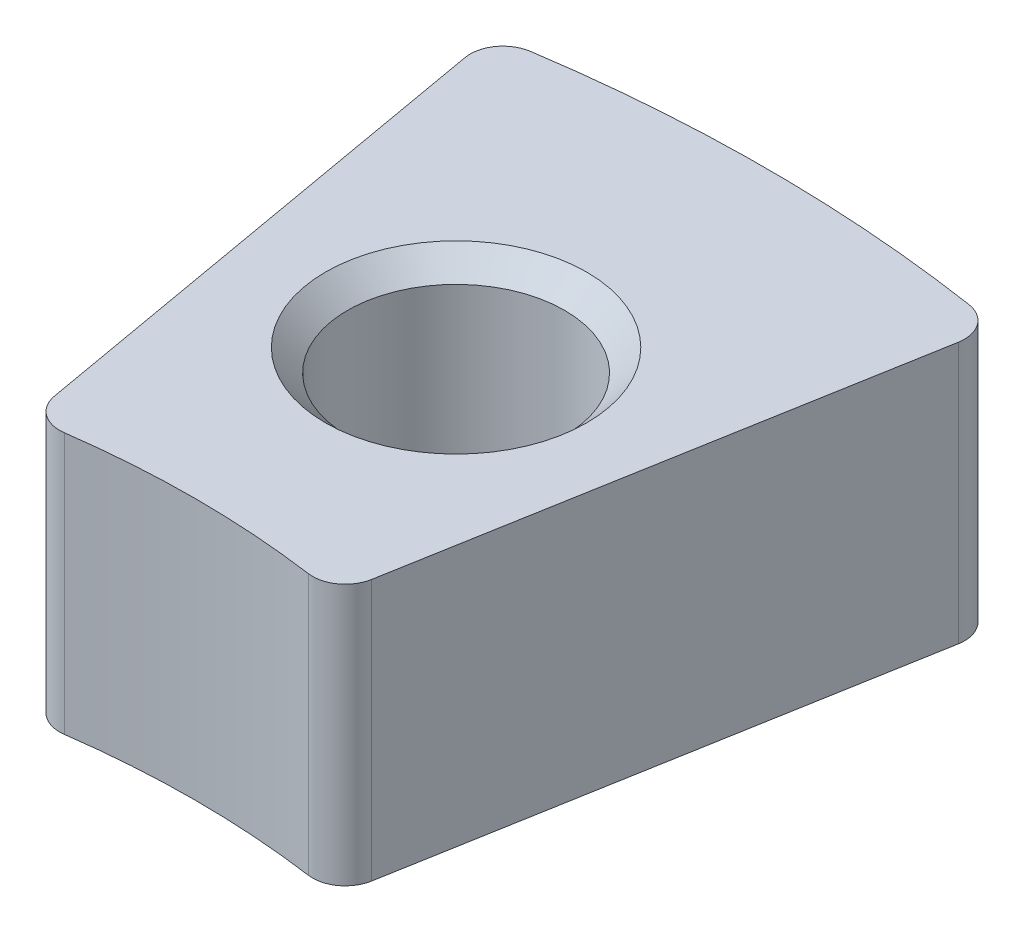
from build123d import *

# Parameters (mm, degrees)
LINEAR_AUSTRAGEN1_DEPTH = 8


with BuildPart() as part:
    # Skizze1 → Linear austragen1 (new body)
    with BuildSketch(Plane(origin=(0, 0, 0), x_dir=(1, 0, 0), z_dir=(0, 1, 0))):
        with BuildLine():
            Line((-7.551699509, 7.827816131), (-4.859047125, -7.44297438))
            ThreePointArc((-4.859047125, -7.44297438), (-4.46235437, -8.078103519), (-3.73587368, -8.259707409))
            ThreePointArc((-3.73587368, -8.259707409), (0, -8), (3.73587368, -8.259707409))
            ThreePointArc((3.73587368, -8.259707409), (4.46235437, -8.078103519), (4.859047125, -7.44297438))
            Line((4.859047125, -7.44297438), (7.551699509, 7.827816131))
            ThreePointArc((7.551699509, 7.827816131), (7.37939641, 8.584419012), (6.717854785, 8.990003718))
            ThreePointArc((6.717854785, 8.990003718), (0, 9.5), (-6.717854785, 8.990003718))
            ThreePointArc((-6.717854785, 8.990003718), (-7.37939641, 8.584419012), (-7.551699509, 7.827816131))
        make_face()
    extrude(amount=LINEAR_AUSTRAGEN1_DEPTH)

    # Skizze2 → Schnitt-Rotation1 (revolve, cut)
    with BuildSketch(Plane.XY, mode=Mode.PRIVATE) as schnitt_rotation1_sk:
        Polygon((0, 8), (4, 8), (3.3235, 7.3235), (3.3235, 0.6765), (4, 0), (0, 0), align=None)
    revolve(schnitt_rotation1_sk.sketch.rotate(Axis((0, 0, 0), (0, 1, 0)), 270), axis=Axis((0, 0, 0), (0, 1, 0)), mode=Mode.SUBTRACT)


solid = part.part
